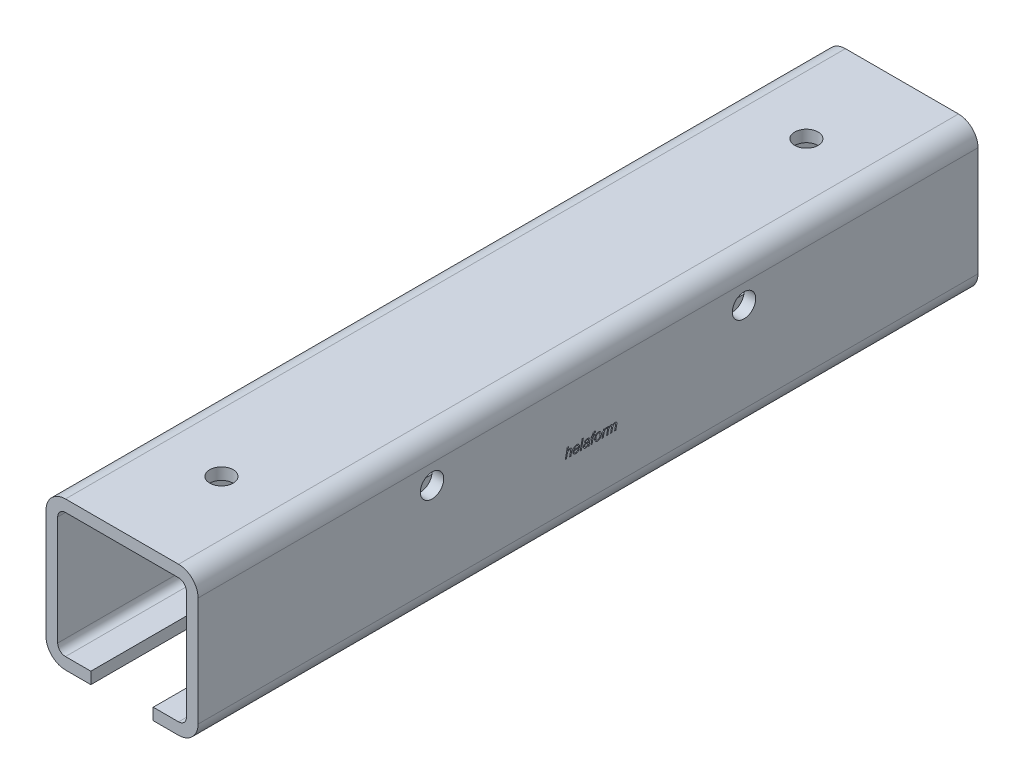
from build123d import *

# Parameters (mm, degrees)
EXTRUDE1_DEPTH     = 100
EXTRUDE2_REACH     = 110.739
SKETCH2_R          = 3
EXTRUDE3_REACH     = 115.864
SKETCH3_R          = 3
CUT_EXTRUDE1_DEPTH = 1


with BuildPart() as part:
    # Sketch1 → Extrude1 (new, symmetric)
    with BuildSketch(Plane.XY):
        with BuildLine():
            Line((0, 0), (14.5, 0))
            ThreePointArc((14.5, 0), (18.035533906, -1.464466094), (19.5, -5))
            Line((19.5, -5), (19.5, -33))
            ThreePointArc((19.5, -33), (18.035533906, -36.535533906), (14.5, -38))
            Line((14.5, -38), (8, -38))
            Line((8, -38), (8, -35))
            Line((8, -35), (14.5, -35))
            ThreePointArc((14.5, -35), (15.914213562, -34.414213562), (16.5, -33))
            Line((16.5, -33), (16.5, -5))
            ThreePointArc((16.5, -5), (15.914213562, -3.585786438), (14.5, -3))
            Line((14.5, -3), (0, -3))
            Line((0, -3), (-14.5, -3))
            ThreePointArc((-14.5, -3), (-15.914213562, -3.585786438), (-16.5, -5))
            Line((-16.5, -5), (-16.5, -33))
            ThreePointArc((-16.5, -33), (-15.914213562, -34.414213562), (-14.5, -35))
            Line((-14.5, -35), (-8, -35))
            Line((-8, -35), (-8, -38))
            Line((-8, -38), (-14.5, -38))
            ThreePointArc((-14.5, -38), (-18.035533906, -36.535533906), (-19.5, -33))
            Line((-19.5, -33), (-19.5, -5))
            ThreePointArc((-19.5, -5), (-18.035533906, -1.464466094), (-14.5, 0))
            Line((-14.5, 0), (0, 0))
        make_face()
    extrude(amount=EXTRUDE1_DEPTH, both=True)

    # Sketch2 → Extrude2 (cut, up to next)
    with BuildSketch(Plane(origin=(0, 0, 0), x_dir=(1, 0, 0), z_dir=(0, 1, 0)), mode=Mode.PRIVATE) as extrude2_sk1:
        with Locations(Location((0.5, -75, 0), (0, 0, 180))):
            Circle(SKETCH2_R)
    extrude2_tool1 = extrude(extrude2_sk1.sketch, amount=-EXTRUDE2_REACH, mode=Mode.PRIVATE) & part.part
    # Sketch2 → Extrude2 (cut, up to next)
    with BuildSketch(Plane(origin=(0, 0, 0), x_dir=(1, 0, 0), z_dir=(0, 1, 0)), mode=Mode.PRIVATE) as extrude2_sk2:
        with Locations(Location((0.5, 75, 0), (0, 0, 270))):
            Circle(SKETCH2_R)
    extrude2_tool2 = extrude(extrude2_sk2.sketch, amount=-EXTRUDE2_REACH, mode=Mode.PRIVATE) & part.part
    add(extrude2_tool1.solids().sort_by_distance((0.5, 0, 75))[0], mode=Mode.SUBTRACT)
    add(extrude2_tool2.solids().sort_by_distance((0.5, 0, -75))[0], mode=Mode.SUBTRACT)

    # Sketch3 → Extrude3 (cut, up to next)
    with BuildSketch(Plane(origin=(19.5, 0, 0), x_dir=(0, 0, -1), z_dir=(1, 0, 0)), mode=Mode.PRIVATE) as extrude3_sk1:
        with Locations(Location((-40, -10, 0), (0, 0, 90))):
            Circle(SKETCH3_R)
    extrude3_tool1 = extrude(extrude3_sk1.sketch, amount=-EXTRUDE3_REACH, mode=Mode.PRIVATE) & part.part
    # Sketch3 → Extrude3 (cut, up to next)
    with BuildSketch(Plane(origin=(19.5, 0, 0), x_dir=(0, 0, -1), z_dir=(1, 0, 0)), mode=Mode.PRIVATE) as extrude3_sk2:
        with Locations(Location((40, -10, 0), (0, 0, 90))):
            Circle(SKETCH3_R)
    extrude3_tool2 = extrude(extrude3_sk2.sketch, amount=-EXTRUDE3_REACH, mode=Mode.PRIVATE) & part.part
    add(extrude3_tool1.solids().sort_by_distance((19.5, -10, 40))[0], mode=Mode.SUBTRACT)
    add(extrude3_tool2.solids().sort_by_distance((19.5, -10, -40))[0], mode=Mode.SUBTRACT)

    # Sketch4 → Cut-Extrude1 (cut)
    # profile 1 of 8: a face of its own
    with BuildSketch(Plane(origin=(19.5, 0, 0), x_dir=(0, 0, -1), z_dir=(1, 0, 0))):
        with BuildLine():
            Line((-5.824893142, -21.343314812), (-5.312072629, -18.843314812))
            Line((-5.312072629, -18.843314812), (-5.018603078, -18.843314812))
            Line((-5.018603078, -18.843314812), (-5.21842279, -19.815870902))
            add(Edge.make_bspline(
                [(-5.21842279, -19.815870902), (-5.191202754, -19.787998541), (-5.139357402, -19.73491072), (-5.060214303, -19.664139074), (-4.98344993, -19.606682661), (-4.908891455, -19.560800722), (-4.834657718, -19.527092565), (-4.760579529, -19.501649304), (-4.68493426, -19.487584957), (-4.634206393, -19.485418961), (-4.608947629, -19.484340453)],
                knots=[0, 0, 0, 0, 1.308535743, 2.49233682, 3.562295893, 4.525943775, 5.426764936, 6.295690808, 7.151378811, 8, 8, 8, 8], degree=3))
            add(Edge.make_bspline(
                [(-4.608947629, -19.484340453), (-4.591240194, -19.484759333), (-4.55657288, -19.48557941), (-4.506105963, -19.490961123), (-4.458650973, -19.500472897), (-4.414292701, -19.513926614), (-4.37314081, -19.531653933), (-4.334693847, -19.552455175), (-4.300014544, -19.57807862), (-4.267742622, -19.606376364), (-4.239578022, -19.638453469), (-4.214393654, -19.672722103), (-4.194382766, -19.710164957), (-4.176081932, -19.749249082), (-4.163659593, -19.791560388), (-4.153838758, -19.835855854), (-4.148447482, -19.882679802), (-4.147628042, -19.914683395), (-4.147208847, -19.931055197)],
                knots=[0, 0, 0, 0, 1.169014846, 2.288677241, 3.345563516, 4.35999745, 5.342562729, 6.299516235, 7.238597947, 8.183095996, 9.127594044, 10.051288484, 10.983620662, 11.925801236, 12.894862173, 13.887022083, 14.91908212, 16, 16, 16, 16], degree=3))
            add(Edge.make_bspline(
                [(-4.147208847, -19.931055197), (-4.147476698, -19.939738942), (-4.148069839, -19.958968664), (-4.150619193, -19.990230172), (-4.155242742, -20.0264686), (-4.161975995, -20.067482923), (-4.169817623, -20.113624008), (-4.180105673, -20.164627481), (-4.191424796, -20.220796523), (-4.200212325, -20.259765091), (-4.204800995, -20.28011369)],
                knots=[0, 0, 0, 0, 0.588475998, 1.303150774, 2.123698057, 3.062574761, 4.118571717, 5.294001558, 6.586982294, 8, 8, 8, 8], degree=3))
            Line((-4.204800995, -20.28011369), (-4.441680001, -21.343314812))
            Line((-4.441680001, -21.343314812), (-4.735149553, -21.343314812))
            Line((-4.735149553, -21.343314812), (-4.497769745, -20.22151994))
            add(Edge.make_bspline(
                [(-4.497769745, -20.22151994), (-4.493759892, -20.202156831), (-4.486125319, -20.165290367), (-4.475310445, -20.112790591), (-4.467256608, -20.065734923), (-4.4592417, -20.02464505), (-4.453956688, -19.989018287), (-4.449625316, -19.959182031), (-4.447703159, -19.934914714), (-4.446995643, -19.920706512), (-4.446688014, -19.914528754)],
                knots=[0, 0, 0, 0, 1.523510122, 2.900692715, 4.129268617, 5.201396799, 6.125444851, 6.903953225, 7.523436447, 8, 8, 8, 8], degree=3))
            add(Edge.make_bspline(
                [(-4.446688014, -19.914528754), (-4.447242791, -19.900089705), (-4.448326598, -19.871881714), (-4.460205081, -19.831959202), (-4.479358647, -19.796237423), (-4.505413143, -19.764935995), (-4.539104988, -19.73949987), (-4.579826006, -19.721394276), (-4.627059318, -19.710285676), (-4.660798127, -19.709246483), (-4.678559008, -19.708699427)],
                knots=[0, 0, 0, 0, 0.987245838, 1.928674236, 2.824499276, 3.750363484, 4.697752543, 5.691079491, 6.784531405, 8, 8, 8, 8], degree=3))
            add(Edge.make_bspline(
                [(-4.678559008, -19.708699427), (-4.705524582, -19.709913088), (-4.759157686, -19.712326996), (-4.838674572, -19.730150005), (-4.916010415, -19.759363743), (-4.990344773, -19.80001549), (-5.059606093, -19.850253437), (-5.122062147, -19.909580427), (-5.176409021, -19.977572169), (-5.214572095, -20.041648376), (-5.241618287, -20.098973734), (-5.262185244, -20.148324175), (-5.281320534, -20.204230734), (-5.300984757, -20.265760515), (-5.319955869, -20.333593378), (-5.338333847, -20.407607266), (-5.356391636, -20.487751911), (-5.36745232, -20.543342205), (-5.373170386, -20.572080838)],
                knots=[0, 0, 0, 0, 1.06375668, 2.115755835, 3.200026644, 4.317463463, 5.44956746, 6.568091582, 7.707210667, 8.87448921, 9.502236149, 10.208264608, 10.983462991, 11.833661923, 12.757731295, 13.762901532, 14.843482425, 16, 16, 16, 16], degree=3))
            Line((-5.373170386, -20.572080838), (-5.531423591, -21.343314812))
            Line((-5.531423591, -21.343314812), (-5.824893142, -21.343314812))
        make_face()
    # profile 2 of 8: a face of its own
    with BuildSketch(Plane(origin=(19.5, 0, 0), x_dir=(0, 0, -1), z_dir=(1, 0, 0))):
        with BuildLine():
            Line((-2.610750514, -20.734340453), (-2.313274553, -20.766391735))
            add(Edge.make_bspline(
                [(-2.313274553, -20.766391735), (-2.319091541, -20.784554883), (-2.330837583, -20.821231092), (-2.355416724, -20.874568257), (-2.385196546, -20.927007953), (-2.41929597, -20.979465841), (-2.458935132, -21.031069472), (-2.504349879, -21.081553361), (-2.554387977, -21.131669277), (-2.609083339, -21.180331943), (-2.667224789, -21.226437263), (-2.729788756, -21.266089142), (-2.79490805, -21.299553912), (-2.862649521, -21.327572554), (-2.93331492, -21.348887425), (-3.006809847, -21.364603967), (-3.083111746, -21.373651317), (-3.134899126, -21.374789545), (-3.161131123, -21.375366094)],
                knots=[0, 0, 0, 0, 0.821440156, 1.658705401, 2.525323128, 3.419405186, 4.353419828, 5.32681938, 6.344399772, 7.404443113, 8.481060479, 9.538977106, 10.591299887, 11.633537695, 12.694215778, 13.768160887, 14.869500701, 16, 16, 16, 16], degree=3))
            add(Edge.make_bspline(
                [(-3.161131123, -21.375366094), (-3.193751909, -21.374142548), (-3.258272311, -21.371722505), (-3.353011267, -21.354518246), (-3.443491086, -21.32508148), (-3.528978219, -21.28465117), (-3.608159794, -21.233643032), (-3.676703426, -21.169657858), (-3.736723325, -21.096697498), (-3.784956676, -21.012812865), (-3.823024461, -20.921015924), (-3.849702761, -20.82217418), (-3.866835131, -20.717406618), (-3.868773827, -20.645433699), (-3.869764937, -20.608639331)],
                knots=[0, 0, 0, 0, 0.998551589, 1.975027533, 2.936744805, 3.903838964, 4.863557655, 5.807675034, 6.763178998, 7.745855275, 8.758641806, 9.797744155, 10.874151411, 12, 12, 12, 12], degree=3))
            add(Edge.make_bspline(
                [(-3.869764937, -20.608639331), (-3.869423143, -20.584084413), (-3.868738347, -20.534887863), (-3.861836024, -20.461509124), (-3.851548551, -20.388547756), (-3.836253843, -20.316392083), (-3.817375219, -20.244571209), (-3.793705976, -20.173588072), (-3.766020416, -20.103013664), (-3.734240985, -20.033644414), (-3.69925618, -19.966588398), (-3.660778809, -19.903869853), (-3.620974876, -19.844873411), (-3.577930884, -19.790801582), (-3.53200439, -19.741476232), (-3.484005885, -19.696443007), (-3.433733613, -19.655369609), (-3.380469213, -19.619541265), (-3.325710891, -19.58769044), (-3.269795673, -19.559758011), (-3.212435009, -19.536752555), (-3.153995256, -19.51787396), (-3.094690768, -19.502525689), (-3.034206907, -19.492232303), (-2.972656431, -19.485337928), (-2.931115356, -19.484674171), (-2.910229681, -19.484340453)],
                knots=[0, 0, 0, 0, 1.075906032, 2.155611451, 3.227554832, 4.30373447, 5.38628686, 6.480642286, 7.581143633, 8.707391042, 9.82337293, 10.893692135, 11.930684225, 12.940768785, 13.919223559, 14.881988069, 15.823529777, 16.761054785, 17.692163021, 18.598508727, 19.497917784, 20.397951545, 21.288749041, 22.180057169, 23.084984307, 24, 24, 24, 24], degree=3))
            add(Edge.make_bspline(
                [(-2.910229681, -19.484340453), (-2.883989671, -19.48484334), (-2.832829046, -19.485823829), (-2.758048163, -19.495638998), (-2.68741827, -19.511465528), (-2.620740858, -19.533819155), (-2.557675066, -19.56148276), (-2.49941259, -19.597107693), (-2.444994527, -19.638334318), (-2.394921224, -19.685454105), (-2.349640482, -19.737987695), (-2.310837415, -19.795984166), (-2.276624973, -19.857820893), (-2.249859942, -19.924903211), (-2.22875449, -19.996328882), (-2.213862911, -20.072443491), (-2.204738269, -20.153020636), (-2.2036527, -20.208307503), (-2.20309827, -20.236543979)],
                knots=[0, 0, 0, 0, 1.079196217, 2.10412856, 3.097265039, 4.052997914, 4.993829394, 5.924450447, 6.855882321, 7.798592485, 8.748507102, 9.702980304, 10.665060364, 11.651045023, 12.668191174, 13.725659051, 14.838433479, 16, 16, 16, 16], degree=3))
            add(Edge.make_bspline(
                [(-2.20309827, -20.236543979), (-2.204210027, -20.281525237), (-2.20647456, -20.373147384), (-2.219834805, -20.463822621), (-2.226635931, -20.509981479)],
                knots=[0, 0, 0, 0, 0.981886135, 2, 2, 2, 2], degree=3))
            Line((-2.226635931, -20.509981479), (-3.549252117, -20.509981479))
            add(Edge.make_bspline(
                [(-3.549252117, -20.509981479), (-3.554107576, -20.518907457), (-3.56326165, -20.535735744), (-3.573658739, -20.561324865), (-3.579939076, -20.585631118), (-3.580865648, -20.601597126), (-3.581303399, -20.609140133)],
                knots=[0, 0, 0, 0, 1.156942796, 2.181202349, 3.140724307, 4, 4, 4, 4], degree=3))
            add(Edge.make_bspline(
                [(-3.581303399, -20.609140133), (-3.580907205, -20.630520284), (-3.580138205, -20.672018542), (-3.57454868, -20.732247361), (-3.565693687, -20.788703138), (-3.552974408, -20.841279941), (-3.535526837, -20.889645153), (-3.51567857, -20.934659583), (-3.491835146, -20.97592498), (-3.463409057, -21.012335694), (-3.433072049, -21.045084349), (-3.400269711, -21.07293253), (-3.366642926, -21.09753248), (-3.330794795, -21.117222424), (-3.293147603, -21.13201875), (-3.254158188, -21.14337228), (-3.213441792, -21.149980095), (-3.185693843, -21.150661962), (-3.17164795, -21.15100712)],
                knots=[0, 0, 0, 0, 1.346284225, 2.613098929, 3.805631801, 4.942804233, 6.013450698, 7.039235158, 8.038108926, 9.00533571, 9.942442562, 10.84439418, 11.710848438, 12.56244313, 13.41163356, 14.253504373, 15.115931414, 16, 16, 16, 16], degree=3))
            add(Edge.make_bspline(
                [(-3.17164795, -21.15100712), (-3.144628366, -21.149846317), (-3.090141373, -21.147505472), (-3.009677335, -21.125147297), (-2.92945274, -21.092150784), (-2.865409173, -21.05282089), (-2.814961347, -21.016420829), (-2.779681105, -20.984460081), (-2.745626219, -20.950392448), (-2.714445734, -20.912684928), (-2.684563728, -20.872678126), (-2.657684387, -20.829257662), (-2.63235179, -20.78329449), (-2.618021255, -20.750817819), (-2.610750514, -20.734340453)],
                knots=[0, 0, 0, 0, 1.313044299, 2.647851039, 4.03980324, 5.527339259, 6.29475363, 7.066375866, 7.842396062, 8.63863277, 9.446691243, 10.272184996, 11.123375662, 12, 12, 12, 12], degree=3))
        make_face()
        with BuildLine():
            Line((-3.500173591, -20.285622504), (-2.493062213, -20.285622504))
            add(Edge.make_bspline(
                [(-2.493062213, -20.285622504), (-2.492702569, -20.271266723), (-2.492100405, -20.247230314), (-2.491715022, -20.223189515), (-2.491559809, -20.21350712)],
                knots=[0, 0, 0, 0, 1.194503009, 2, 2, 2, 2], degree=3))
            add(Edge.make_bspline(
                [(-2.491559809, -20.21350712), (-2.492028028, -20.193802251), (-2.492942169, -20.155330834), (-2.497601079, -20.099355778), (-2.506807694, -20.046999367), (-2.518999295, -19.998067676), (-2.535870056, -19.953031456), (-2.554978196, -19.910993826), (-2.579047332, -19.873172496), (-2.605866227, -19.838760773), (-2.635544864, -19.807991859), (-2.667488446, -19.781476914), (-2.701674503, -19.759154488), (-2.73758817, -19.740387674), (-2.776131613, -19.726625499), (-2.816243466, -19.715788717), (-2.858636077, -19.709840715), (-2.887509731, -19.709084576), (-2.90221686, -19.708699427)],
                knots=[0, 0, 0, 0, 1.288915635, 2.516454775, 3.668675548, 4.762204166, 5.808675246, 6.809806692, 7.776046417, 8.732555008, 9.659000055, 10.566141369, 11.441184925, 12.324901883, 13.209090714, 14.112018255, 15.038334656, 16, 16, 16, 16], degree=3))
            add(Edge.make_bspline(
                [(-2.90221686, -19.708699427), (-2.918442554, -19.708971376), (-2.950552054, -19.709509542), (-2.998051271, -19.717278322), (-3.044725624, -19.727721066), (-3.08992625, -19.744296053), (-3.134253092, -19.764299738), (-3.17758822, -19.788776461), (-3.219019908, -19.818958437), (-3.260211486, -19.852125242), (-3.299495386, -19.890330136), (-3.335720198, -19.933599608), (-3.370315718, -19.980764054), (-3.400779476, -20.033260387), (-3.430440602, -20.089354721), (-3.455881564, -20.150839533), (-3.4804052, -20.216263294), (-3.493482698, -20.262146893), (-3.500173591, -20.285622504)],
                knots=[0, 0, 0, 0, 0.867869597, 1.717452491, 2.571772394, 3.425671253, 4.289803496, 5.174634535, 6.084973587, 7.031591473, 8.005136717, 9.013559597, 10.050697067, 11.133079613, 12.260592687, 13.446148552, 14.693362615, 16, 16, 16, 16], degree=3))
        make_face(mode=Mode.SUBTRACT)
    # profile 3 of 8: a face of its own
    with BuildSketch(Plane(origin=(19.5, 0, 0), x_dir=(0, 0, -1), z_dir=(1, 0, 0))):
        Polygon((-2.008787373, -21.343314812), (-1.497970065, -18.843314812), (-1.204500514, -18.843314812), (-1.715317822, -21.343314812), align=None)
    # profile 4 of 8: a face of its own
    with BuildSketch(Plane(origin=(19.5, 0, 0), x_dir=(0, 0, -1), z_dir=(1, 0, 0))):
        with BuildLine():
            add(Edge.make_bspline(
                [(0.008440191, -21.11995744), (-0.017810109, -21.141534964), (-0.068535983, -21.183231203), (-0.146772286, -21.237524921), (-0.223643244, -21.281996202), (-0.299705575, -21.317173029), (-0.376182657, -21.343745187), (-0.454850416, -21.361408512), (-0.535711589, -21.373688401), (-0.590805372, -21.374804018), (-0.618563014, -21.375366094)],
                knots=[0, 0, 0, 0, 1.176742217, 2.273927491, 3.294581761, 4.249353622, 5.172863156, 6.093035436, 7.039223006, 8, 8, 8, 8], degree=3))
            add(Edge.make_bspline(
                [(-0.618563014, -21.375366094), (-0.638942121, -21.374803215), (-0.678968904, -21.37369766), (-0.737527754, -21.367454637), (-0.79296922, -21.355773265), (-0.845326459, -21.33980227), (-0.894638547, -21.319159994), (-0.941164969, -21.294127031), (-0.984116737, -21.263753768), (-1.024356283, -21.229900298), (-1.060174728, -21.191994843), (-1.091390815, -21.151107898), (-1.118214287, -21.107969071), (-1.139709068, -21.061981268), (-1.156938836, -21.013746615), (-1.16894879, -20.962694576), (-1.175924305, -20.909147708), (-1.176941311, -20.872581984), (-1.177457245, -20.85403196)],
                knots=[0, 0, 0, 0, 1.139245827, 2.237602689, 3.286124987, 4.301365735, 5.2925262, 6.269488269, 7.247875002, 8.227506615, 9.204290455, 10.15602149, 11.098561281, 12.037631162, 12.987851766, 13.95644656, 14.963292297, 16, 16, 16, 16], degree=3))
            add(Edge.make_bspline(
                [(-1.177457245, -20.85403196), (-1.176827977, -20.829589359), (-1.175594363, -20.781672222), (-1.161822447, -20.712477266), (-1.14165235, -20.647139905), (-1.111674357, -20.587136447), (-1.07500159, -20.532076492), (-1.032868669, -20.482072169), (-0.984728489, -20.438218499), (-0.931183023, -20.399774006), (-0.871509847, -20.367187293), (-0.805924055, -20.339887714), (-0.734572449, -20.316294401), (-0.684134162, -20.305970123), (-0.658126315, -20.300646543)],
                knots=[0, 0, 0, 0, 1.057058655, 2.072251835, 3.043911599, 4.010610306, 4.965012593, 5.903623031, 6.834882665, 7.777798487, 8.75171468, 9.772170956, 10.851248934, 12, 12, 12, 12], degree=3))
            add(Edge.make_bspline(
                [(-0.658126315, -20.300646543), (-0.648289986, -20.298893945), (-0.627015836, -20.295103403), (-0.592053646, -20.290830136), (-0.551652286, -20.286350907), (-0.505593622, -20.28177382), (-0.453997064, -20.27781833), (-0.396880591, -20.274513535), (-0.334298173, -20.270791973), (-0.267825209, -20.268164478), (-0.200999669, -20.265067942), (-0.137394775, -20.259946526), (-0.078784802, -20.253967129), (-0.025262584, -20.247274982), (0.023138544, -20.238582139), (0.066446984, -20.229255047), (0.105073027, -20.219003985), (0.128524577, -20.210180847), (0.139650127, -20.205995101)],
                knots=[0, 0, 0, 0, 0.595113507, 1.287119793, 2.097608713, 3.016901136, 4.044304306, 5.180150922, 6.425203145, 7.779016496, 9.143236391, 10.410139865, 11.579789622, 12.652956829, 13.622514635, 14.508107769, 15.292237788, 16, 16, 16, 16], degree=3))
            add(Edge.make_bspline(
                [(0.139650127, -20.205995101), (0.143925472, -20.184481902), (0.152089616, -20.143400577), (0.162156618, -20.084392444), (0.167059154, -20.0307975), (0.168173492, -19.997000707), (0.168696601, -19.981135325)],
                knots=[0, 0, 0, 0, 1.159062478, 2.213330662, 3.161275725, 4, 4, 4, 4], degree=3))
            add(Edge.make_bspline(
                [(0.168696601, -19.981135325), (0.168038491, -19.962808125), (0.166776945, -19.927676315), (0.151355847, -19.878529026), (0.127923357, -19.834549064), (0.10444198, -19.811828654), (0.092574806, -19.800346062)],
                knots=[0, 0, 0, 0, 1.082179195, 2.074452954, 3.026854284, 4, 4, 4, 4], degree=3))
            add(Edge.make_bspline(
                [(0.092574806, -19.800346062), (0.083568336, -19.792924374), (0.065357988, -19.777918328), (0.034165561, -19.759500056), (0.000413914, -19.743401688), (-0.03669588, -19.731049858), (-0.076376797, -19.721095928), (-0.119001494, -19.713371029), (-0.164771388, -19.709683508), (-0.196215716, -19.709033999), (-0.212413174, -19.708699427)],
                knots=[0, 0, 0, 0, 0.859677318, 1.738197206, 2.663619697, 3.613780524, 4.617262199, 5.680109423, 6.804988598, 8, 8, 8, 8], degree=3))
            add(Edge.make_bspline(
                [(-0.212413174, -19.708699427), (-0.242565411, -19.709556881), (-0.300592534, -19.711207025), (-0.383145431, -19.729389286), (-0.457822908, -19.757560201), (-0.523003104, -19.799025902), (-0.579863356, -19.850202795), (-0.62792771, -19.911487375), (-0.667970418, -19.982271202), (-0.686919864, -20.034394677), (-0.696688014, -20.06126353)],
                knots=[0, 0, 0, 0, 1.116846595, 2.149339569, 3.120005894, 4.063359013, 4.997375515, 5.94525119, 6.940808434, 8, 8, 8, 8], degree=3))
            Line((-0.696688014, -20.06126353), (-0.985149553, -20.029212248))
            add(Edge.make_bspline(
                [(-0.985149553, -20.029212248), (-0.977244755, -20.007735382), (-0.961726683, -19.965573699), (-0.934039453, -19.905011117), (-0.902623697, -19.848638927), (-0.867758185, -19.796216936), (-0.830110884, -19.747365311), (-0.789226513, -19.702130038), (-0.744147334, -19.661429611), (-0.696122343, -19.624379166), (-0.64488764, -19.591031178), (-0.59014956, -19.562530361), (-0.532104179, -19.53849541), (-0.471112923, -19.518253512), (-0.406640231, -19.503541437), (-0.339239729, -19.492573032), (-0.268500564, -19.485153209), (-0.220111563, -19.484615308), (-0.195385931, -19.484340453)],
                knots=[0, 0, 0, 0, 1.062635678, 2.086082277, 3.089150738, 4.056806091, 5.007446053, 5.951423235, 6.884447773, 7.824212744, 8.766149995, 9.719820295, 10.6859836, 11.681412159, 12.700709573, 13.753541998, 14.852113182, 16, 16, 16, 16], degree=3))
            add(Edge.make_bspline(
                [(-0.195385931, -19.484340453), (-0.169324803, -19.484795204), (-0.118425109, -19.485683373), (-0.044106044, -19.493361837), (0.026111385, -19.505636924), (0.092103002, -19.523290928), (0.154075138, -19.545504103), (0.211253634, -19.574056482), (0.265033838, -19.606304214), (0.297337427, -19.63219914), (0.313428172, -19.645097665)],
                knots=[0, 0, 0, 0, 1.147245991, 2.240673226, 3.286002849, 4.282675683, 5.245377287, 6.178960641, 7.092921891, 8, 8, 8, 8], degree=3))
            add(Edge.make_bspline(
                [(0.313428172, -19.645097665), (0.324833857, -19.655219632), (0.347394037, -19.675240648), (0.376897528, -19.708780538), (0.401683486, -19.744643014), (0.42181525, -19.782686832), (0.438239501, -19.822816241), (0.448740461, -19.865713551), (0.456355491, -19.910418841), (0.456887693, -19.941036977), (0.45715814, -19.956596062)],
                knots=[0, 0, 0, 0, 1.030059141, 2.037432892, 3.010866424, 3.970002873, 4.942258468, 5.933000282, 6.949621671, 8, 8, 8, 8], degree=3))
            add(Edge.make_bspline(
                [(0.45715814, -19.956596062), (0.456822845, -19.981819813), (0.456124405, -20.034362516), (0.448296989, -20.115852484), (0.43758851, -20.203279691), (0.427057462, -20.263128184), (0.421601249, -20.294136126)],
                knots=[0, 0, 0, 0, 0.890374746, 1.854708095, 2.888508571, 4, 4, 4, 4], degree=3))
            Line((0.421601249, -20.294136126), (0.336965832, -20.745858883))
            add(Edge.make_bspline(
                [(0.336965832, -20.745858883), (0.330856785, -20.78003868), (0.319234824, -20.845062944), (0.306849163, -20.937958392), (0.29862056, -21.020818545), (0.297448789, -21.072699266), (0.29690173, -21.096920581)],
                knots=[0, 0, 0, 0, 1.17760315, 2.240293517, 3.178453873, 4, 4, 4, 4], degree=3))
            add(Edge.make_bspline(
                [(0.29690173, -21.096920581), (0.297348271, -21.112794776), (0.298328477, -21.147640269), (0.305195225, -21.2045474), (0.314265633, -21.270971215), (0.323517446, -21.318150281), (0.32845221, -21.343314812)],
                knots=[0, 0, 0, 0, 0.765813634, 1.681039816, 2.763105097, 4, 4, 4, 4], degree=3))
            Line((0.32845221, -21.343314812), (0.037486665, -21.343314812))
            add(Edge.make_bspline(
                [(0.037486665, -21.343314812), (0.034148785, -21.327653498), (0.027079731, -21.29448554), (0.019444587, -21.241445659), (0.012841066, -21.18266027), (0.009952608, -21.141506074), (0.008440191, -21.11995744)],
                knots=[0, 0, 0, 0, 0.852057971, 1.804511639, 2.850426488, 4, 4, 4, 4], degree=3))
        make_face()
        with BuildLine():
            add(Edge.make_bspline(
                [(0.10158923, -20.401808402), (0.081379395, -20.409936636), (0.040191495, -20.42650208), (-0.0166043, -20.440943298), (-0.071695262, -20.450004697), (-0.128730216, -20.456526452), (-0.201147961, -20.464253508), (-0.254633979, -20.468555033), (-0.284027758, -20.470918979)],
                knots=[0, 0, 0, 0, 0.995082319, 2.02799051, 2.670388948, 3.546965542, 4.651910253, 6, 6, 6, 6], degree=3))
            add(Edge.make_bspline(
                [(-0.284027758, -20.470918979), (-0.305239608, -20.472990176), (-0.346030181, -20.476973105), (-0.404735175, -20.484307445), (-0.458787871, -20.490779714), (-0.508088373, -20.499259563), (-0.552938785, -20.506876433), (-0.59318207, -20.515461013), (-0.628667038, -20.524267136), (-0.668841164, -20.536731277), (-0.713218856, -20.554714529), (-0.759932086, -20.582624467), (-0.800364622, -20.615662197), (-0.832337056, -20.655311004), (-0.857339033, -20.69838295), (-0.875523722, -20.743920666), (-0.887210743, -20.791681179), (-0.88839526, -20.824416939), (-0.888995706, -20.841011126)],
                knots=[0, 0, 0, 0, 1.291140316, 2.482874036, 3.58428306, 4.588539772, 5.513036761, 6.340191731, 7.080974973, 7.727139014, 8.887871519, 9.971916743, 11.013029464, 12.033452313, 13.039540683, 14.019883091, 14.996252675, 16, 16, 16, 16], degree=3))
            add(Edge.make_bspline(
                [(-0.888995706, -20.841011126), (-0.888092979, -20.862678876), (-0.886332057, -20.904945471), (-0.868040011, -20.964965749), (-0.838949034, -21.018985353), (-0.798397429, -21.065875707), (-0.747202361, -21.104735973), (-0.684990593, -21.131485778), (-0.613774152, -21.148348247), (-0.563078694, -21.150091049), (-0.536431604, -21.15100712)],
                knots=[0, 0, 0, 0, 0.980060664, 1.911773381, 2.816178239, 3.744810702, 4.701647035, 5.704679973, 6.793509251, 8, 8, 8, 8], degree=3))
            add(Edge.make_bspline(
                [(-0.536431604, -21.15100712), (-0.510489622, -21.149847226), (-0.458485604, -21.147522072), (-0.381301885, -21.131722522), (-0.306204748, -21.104467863), (-0.233249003, -21.068428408), (-0.165655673, -21.022096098), (-0.105124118, -20.967341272), (-0.054769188, -20.903146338), (-0.020007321, -20.843531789), (0.003877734, -20.790961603), (0.020458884, -20.74693795), (0.037359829, -20.699391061), (0.052079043, -20.647608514), (0.066210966, -20.591849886), (0.078996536, -20.532006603), (0.091138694, -20.468238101), (0.098040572, -20.42436574), (0.10158923, -20.401808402)],
                knots=[0, 0, 0, 0, 1.142235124, 2.289756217, 3.452247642, 4.652135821, 5.863229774, 7.049462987, 8.231909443, 9.44094933, 10.079113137, 10.772583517, 11.511838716, 12.300429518, 13.141924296, 14.044484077, 14.994555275, 16, 16, 16, 16], degree=3))
        make_face(mode=Mode.SUBTRACT)
    # profile 5 of 8: a face of its own
    with BuildSketch(Plane(origin=(19.5, 0, 0), x_dir=(0, 0, -1), z_dir=(1, 0, 0))):
        with BuildLine():
            Line((0.745619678, -21.343314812), (1.068135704, -19.74075071))
            Line((1.068135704, -19.74075071), (0.809722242, -19.74075071))
            Line((0.809722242, -19.74075071), (0.873824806, -19.516391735))
            Line((0.873824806, -19.516391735), (1.124225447, -19.516391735))
            Line((1.124225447, -19.516391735), (1.173804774, -19.267994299))
            add(Edge.make_bspline(
                [(1.173804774, -19.267994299), (1.179918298, -19.239230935), (1.191310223, -19.185633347), (1.210410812, -19.112113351), (1.230489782, -19.051618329), (1.250526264, -19.001745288), (1.274917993, -18.959894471), (1.306201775, -18.924279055), (1.343209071, -18.891908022), (1.386780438, -18.862894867), (1.438552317, -18.838956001), (1.499708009, -18.823015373), (1.569778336, -18.813056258), (1.619646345, -18.811884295), (1.646060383, -18.81126353)],
                knots=[0, 0, 0, 0, 1.429250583, 2.663262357, 3.689602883, 4.525968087, 5.271832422, 6.031341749, 6.819062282, 7.656214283, 8.567470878, 9.577289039, 10.716740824, 12, 12, 12, 12], degree=3))
            add(Edge.make_bspline(
                [(1.646060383, -18.81126353), (1.656411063, -18.811557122), (1.678127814, -18.812173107), (1.712247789, -18.813977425), (1.749446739, -18.818343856), (1.790083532, -18.823628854), (1.833879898, -18.831528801), (1.881243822, -18.839744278), (1.931603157, -18.850439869), (1.966249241, -18.858296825), (1.984101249, -18.862345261)],
                knots=[0, 0, 0, 0, 0.72558998, 1.522359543, 2.392979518, 3.349131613, 4.393312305, 5.510664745, 6.717326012, 8, 8, 8, 8], degree=3))
            Line((1.984101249, -18.862345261), (1.928512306, -19.129272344))
            add(Edge.make_bspline(
                [(1.928512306, -19.129272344), (1.903675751, -19.124701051), (1.856312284, -19.115983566), (1.787935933, -19.107111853), (1.725958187, -19.101166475), (1.686636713, -19.100186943), (1.66809564, -19.099725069)],
                knots=[0, 0, 0, 0, 1.154599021, 2.201827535, 3.152116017, 4, 4, 4, 4], degree=3))
            add(Edge.make_bspline(
                [(1.66809564, -19.099725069), (1.654014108, -19.100030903), (1.627389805, -19.100609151), (1.59020243, -19.109551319), (1.557819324, -19.122744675), (1.529474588, -19.143480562), (1.506576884, -19.176349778), (1.486013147, -19.221766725), (1.467770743, -19.282411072), (1.45743889, -19.328016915), (1.451749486, -19.353130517)],
                knots=[0, 0, 0, 0, 0.903865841, 1.708961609, 2.445191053, 3.14337528, 3.933937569, 4.991014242, 6.34305285, 8, 8, 8, 8], degree=3))
            Line((1.451749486, -19.353130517), (1.4181958, -19.516391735))
            Line((1.4181958, -19.516391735), (1.771260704, -19.516391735))
            Line((1.771260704, -19.516391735), (1.70715814, -19.74075071))
            Line((1.70715814, -19.74075071), (1.362106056, -19.74075071))
            Line((1.362106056, -19.74075071), (1.03908923, -21.343314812))
            Line((1.03908923, -21.343314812), (0.745619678, -21.343314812))
        make_face()
    # profile 6 of 8: a face of its own
    with BuildSketch(Plane(origin=(19.5, 0, 0), x_dir=(0, 0, -1), z_dir=(1, 0, 0))):
        with BuildLine():
            add(Edge.make_bspline(
                [(1.70715814, -20.647701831), (1.708113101, -20.604423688), (1.709984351, -20.51962001), (1.724873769, -20.395322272), (1.748789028, -20.276683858), (1.782149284, -20.163509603), (1.82607768, -20.056278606), (1.879329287, -19.954816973), (1.941928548, -19.858596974), (1.991305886, -19.800189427), (2.016152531, -19.770798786)],
                knots=[0, 0, 0, 0, 1.091636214, 2.139065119, 3.15337043, 4.142118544, 5.111151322, 6.071929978, 7.029796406, 8, 8, 8, 8], degree=3))
            add(Edge.make_bspline(
                [(2.016152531, -19.770798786), (2.037684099, -19.747898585), (2.080204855, -19.702675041), (2.152261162, -19.644614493), (2.228412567, -19.594374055), (2.310422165, -19.554418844), (2.396856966, -19.522346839), (2.48858333, -19.500887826), (2.584954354, -19.486697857), (2.650948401, -19.485138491), (2.684722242, -19.484340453)],
                knots=[0, 0, 0, 0, 1.003816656, 1.982347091, 2.950416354, 3.914638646, 4.892193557, 5.891460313, 6.920910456, 8, 8, 8, 8], degree=3))
            add(Edge.make_bspline(
                [(2.684722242, -19.484340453), (2.711129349, -19.484846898), (2.762788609, -19.485837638), (2.838387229, -19.495675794), (2.910112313, -19.511351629), (2.977729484, -19.534326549), (3.041646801, -19.56254792), (3.101231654, -19.598187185), (3.157118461, -19.639804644), (3.208338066, -19.687952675), (3.255312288, -19.740806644), (3.295210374, -19.799336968), (3.329565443, -19.861834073), (3.357878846, -19.928879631), (3.379092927, -20.000693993), (3.3945708, -20.07675728), (3.404394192, -20.157160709), (3.405374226, -20.212309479), (3.405876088, -20.240550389)],
                knots=[0, 0, 0, 0, 1.074521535, 2.102047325, 3.097891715, 4.058516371, 5.004534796, 5.936932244, 6.87884093, 7.835708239, 8.794022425, 9.751637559, 10.712718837, 11.693422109, 12.708216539, 13.755795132, 14.850774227, 16, 16, 16, 16], degree=3))
            add(Edge.make_bspline(
                [(3.405876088, -20.240550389), (3.405505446, -20.266271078), (3.40476796, -20.317448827), (3.398411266, -20.393477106), (3.389098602, -20.46823177), (3.375638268, -20.54170358), (3.357411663, -20.613645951), (3.335853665, -20.684339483), (3.311003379, -20.753780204), (3.281371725, -20.821028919), (3.248605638, -20.885824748), (3.212621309, -20.947274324), (3.172714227, -21.004372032), (3.13047003, -21.058251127), (3.08391831, -21.10753008), (3.034230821, -21.153018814), (2.981797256, -21.195489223), (2.925568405, -21.232633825), (2.867840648, -21.266032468), (2.809027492, -21.295304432), (2.74943019, -21.31986598), (2.68896414, -21.339855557), (2.627872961, -21.356316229), (2.565631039, -21.366816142), (2.502955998, -21.374503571), (2.460887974, -21.375078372), (2.439830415, -21.375366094)],
                knots=[0, 0, 0, 0, 1.113712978, 2.216010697, 3.301923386, 4.375322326, 5.448404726, 6.514107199, 7.57523888, 8.640352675, 9.694367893, 10.718505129, 11.721213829, 12.709140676, 13.680905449, 14.653046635, 15.625160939, 16.599638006, 17.568089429, 18.512164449, 19.442549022, 20.357011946, 21.268841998, 22.179295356, 23.088628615, 24, 24, 24, 24], degree=3))
            add(Edge.make_bspline(
                [(2.439830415, -21.375366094), (2.405700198, -21.374391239), (2.338501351, -21.372471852), (2.240314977, -21.354798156), (2.146703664, -21.326787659), (2.058717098, -21.287369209), (1.978120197, -21.237450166), (1.906443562, -21.178037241), (1.845758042, -21.108239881), (1.795170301, -21.03001784), (1.755264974, -20.943704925), (1.727728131, -20.85054107), (1.709896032, -20.751212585), (1.708087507, -20.682838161), (1.70715814, -20.647701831)],
                knots=[0, 0, 0, 0, 1.056399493, 2.079940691, 3.079426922, 4.07698514, 5.057020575, 6.007752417, 6.949498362, 7.910468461, 8.884496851, 9.883983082, 10.912618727, 12, 12, 12, 12], degree=3))
        make_face()
        with BuildLine():
            add(Edge.make_bspline(
                [(1.995619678, -20.621159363), (1.995961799, -20.642211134), (1.996625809, -20.683069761), (2.002968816, -20.742435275), (2.012031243, -20.797963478), (2.025709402, -20.849580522), (2.043104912, -20.897297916), (2.064662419, -20.941202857), (2.090374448, -20.980893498), (2.119463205, -21.016830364), (2.152150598, -21.047881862), (2.186190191, -21.07605972), (2.223203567, -21.099110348), (2.262115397, -21.118151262), (2.303294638, -21.132849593), (2.346443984, -21.143194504), (2.39170234, -21.150049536), (2.422610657, -21.150684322), (2.438328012, -21.15100712)],
                knots=[0, 0, 0, 0, 1.295111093, 2.513634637, 3.670576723, 4.754563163, 5.794674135, 6.791678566, 7.757713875, 8.699574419, 9.629537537, 10.528041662, 11.414483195, 12.305852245, 13.189730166, 14.099209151, 15.033418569, 16, 16, 16, 16], degree=3))
            add(Edge.make_bspline(
                [(2.438328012, -21.15100712), (2.4550456, -21.150508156), (2.488646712, -21.149505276), (2.539055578, -21.141830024), (2.589021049, -21.128497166), (2.63887603, -21.11120388), (2.687557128, -21.088021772), (2.734577, -21.059341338), (2.780032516, -21.025677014), (2.822685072, -20.986346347), (2.86378078, -20.943573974), (2.901427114, -20.897097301), (2.936548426, -20.848115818), (2.97841665, -20.778274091), (3.024289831, -20.684891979), (3.050546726, -20.605653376), (3.063828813, -20.565570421)],
                knots=[0, 0, 0, 0, 0.76417638, 1.535937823, 2.324535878, 3.125956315, 3.945310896, 4.784335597, 5.640677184, 6.526804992, 7.433724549, 8.350386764, 9.258910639, 10.186940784, 12.071158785, 14, 14, 14, 14], degree=3))
            add(Edge.make_bspline(
                [(3.063828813, -20.565570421), (3.072143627, -20.537308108), (3.088483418, -20.481768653), (3.104558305, -20.397926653), (3.115245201, -20.315946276), (3.116697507, -20.261783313), (3.11741455, -20.235041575)],
                knots=[0, 0, 0, 0, 1.051458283, 2.066264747, 3.045261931, 4, 4, 4, 4], degree=3))
            add(Edge.make_bspline(
                [(3.11741455, -20.235041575), (3.117063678, -20.214823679), (3.116377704, -20.175296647), (3.110075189, -20.117937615), (3.101077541, -20.063819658), (3.086540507, -20.013597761), (3.069650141, -19.966210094), (3.046946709, -19.923003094), (3.021818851, -19.882588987), (2.991837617, -19.846598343), (2.959573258, -19.814138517), (2.924884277, -19.785813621), (2.888051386, -19.762395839), (2.849614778, -19.742175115), (2.808509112, -19.727627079), (2.765682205, -19.716336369), (2.72082084, -19.709704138), (2.69025265, -19.709038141), (2.674706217, -19.708699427)],
                knots=[0, 0, 0, 0, 1.253550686, 2.450756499, 3.575994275, 4.651243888, 5.689823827, 6.690069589, 7.672416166, 8.636253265, 9.588057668, 10.508190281, 11.407164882, 12.291652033, 13.195740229, 14.104854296, 15.036162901, 16, 16, 16, 16], degree=3))
            add(Edge.make_bspline(
                [(2.674706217, -19.708699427), (2.65061008, -19.709585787), (2.603061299, -19.711334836), (2.533434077, -19.724622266), (2.467036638, -19.746828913), (2.404292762, -19.7782639), (2.344543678, -19.81771179), (2.288365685, -19.865921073), (2.234698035, -19.921742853), (2.184211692, -19.985064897), (2.139146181, -20.055546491), (2.098807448, -20.131571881), (2.066903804, -20.214029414), (2.040651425, -20.299964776), (2.021559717, -20.386062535), (2.006453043, -20.468678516), (1.997701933, -20.546517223), (1.996295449, -20.596935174), (1.995619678, -20.621159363)],
                knots=[0, 0, 0, 0, 0.919050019, 1.813556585, 2.693819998, 3.582615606, 4.483630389, 5.419133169, 6.401208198, 7.434815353, 8.503776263, 9.589310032, 10.713026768, 11.871659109, 13.015133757, 14.075998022, 15.075579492, 16, 16, 16, 16], degree=3))
        make_face(mode=Mode.SUBTRACT)
    # profile 7 of 8: a face of its own
    with BuildSketch(Plane(origin=(19.5, 0, 0), x_dir=(0, 0, -1), z_dir=(1, 0, 0))):
        with BuildLine():
            Line((3.598183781, -21.343314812), (3.982799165, -19.516391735))
            Line((3.982799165, -19.516391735), (4.276268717, -19.516391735))
            Line((4.276268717, -19.516391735), (4.188628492, -19.830394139))
            add(Edge.make_bspline(
                [(4.188628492, -19.830394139), (4.213011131, -19.80255268), (4.259562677, -19.749397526), (4.331311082, -19.677916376), (4.400886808, -19.617824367), (4.468891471, -19.568966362), (4.536370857, -19.530897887), (4.604360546, -19.503993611), (4.673320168, -19.487827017), (4.719563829, -19.485496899), (4.74251471, -19.484340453)],
                knots=[0, 0, 0, 0, 1.317415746, 2.515221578, 3.602797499, 4.587383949, 5.492011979, 6.354026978, 7.183098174, 8, 8, 8, 8], degree=3))
            add(Edge.make_bspline(
                [(4.74251471, -19.484340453), (4.758723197, -19.484767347), (4.792907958, -19.485667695), (4.846574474, -19.492166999), (4.905406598, -19.502194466), (4.946049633, -19.511506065), (4.967374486, -19.516391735)],
                knots=[0, 0, 0, 0, 0.854454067, 1.802099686, 2.846791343, 4, 4, 4, 4], degree=3))
            Line((4.967374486, -19.516391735), (4.842174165, -19.804853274))
            add(Edge.make_bspline(
                [(4.842174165, -19.804853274), (4.829188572, -19.79024871), (4.80462494, -19.762622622), (4.761248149, -19.732037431), (4.715762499, -19.71212321), (4.684111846, -19.709835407), (4.668396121, -19.708699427)],
                knots=[0, 0, 0, 0, 1.139610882, 2.155695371, 3.084234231, 4, 4, 4, 4], degree=3))
            add(Edge.make_bspline(
                [(4.668396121, -19.708699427), (4.654819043, -19.709256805), (4.627171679, -19.710391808), (4.585925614, -19.720583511), (4.544213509, -19.736345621), (4.502216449, -19.758698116), (4.459567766, -19.786989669), (4.416292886, -19.821274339), (4.372830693, -19.862183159), (4.328376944, -19.909197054), (4.285007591, -19.964708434), (4.24383736, -20.029976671), (4.205204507, -20.105262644), (4.168192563, -20.190266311), (4.133136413, -20.285034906), (4.101210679, -20.389938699), (4.069593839, -20.504307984), (4.052023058, -20.584505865), (4.042895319, -20.626167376)],
                knots=[0, 0, 0, 0, 0.549463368, 1.118886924, 1.711931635, 2.353427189, 3.042026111, 3.783708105, 4.587857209, 5.458936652, 6.403515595, 7.437581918, 8.58132111, 9.829397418, 11.192852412, 12.673529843, 14.271952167, 16, 16, 16, 16], degree=3))
            Line((4.042895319, -20.626167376), (3.892154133, -21.343314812))
            Line((3.892154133, -21.343314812), (3.598183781, -21.343314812))
        make_face()
    # profile 8 of 8: a face of its own
    with BuildSketch(Plane(origin=(19.5, 0, 0), x_dir=(0, 0, -1), z_dir=(1, 0, 0))):
        with BuildLine():
            Line((4.752029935, -21.343314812), (5.120118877, -19.516391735))
            Line((5.120118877, -19.516391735), (5.413588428, -19.516391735))
            Line((5.413588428, -19.516391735), (5.347482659, -19.84241337))
            add(Edge.make_bspline(
                [(5.347482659, -19.84241337), (5.361230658, -19.825960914), (5.387789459, -19.794177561), (5.428216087, -19.749411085), (5.467078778, -19.70828271), (5.505132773, -19.671149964), (5.5421179, -19.638123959), (5.577901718, -19.608928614), (5.612122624, -19.583102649), (5.656899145, -19.555421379), (5.712970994, -19.526292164), (5.78390843, -19.50236597), (5.857493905, -19.48725158), (5.90763953, -19.485316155), (5.932919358, -19.484340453)],
                knots=[0, 0, 0, 0, 1.084132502, 2.094360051, 3.049733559, 3.945196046, 4.782250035, 5.556179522, 6.280499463, 6.948038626, 8.216550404, 9.465929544, 10.722503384, 12, 12, 12, 12], degree=3))
            add(Edge.make_bspline(
                [(5.932919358, -19.484340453), (5.959214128, -19.485338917), (6.010191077, -19.487274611), (6.083394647, -19.503937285), (6.149504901, -19.532517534), (6.20868878, -19.571278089), (6.259802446, -19.620246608), (6.301139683, -19.678848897), (6.333503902, -19.746026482), (6.346089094, -19.795051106), (6.352590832, -19.820378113)],
                knots=[0, 0, 0, 0, 1.075592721, 2.085222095, 3.052587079, 4.009808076, 4.966833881, 5.932096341, 6.931683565, 8, 8, 8, 8], degree=3))
            add(Edge.make_bspline(
                [(6.352590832, -19.820378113), (6.37486026, -19.793617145), (6.417977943, -19.74180302), (6.487790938, -19.672738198), (6.55968737, -19.614772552), (6.633199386, -19.567072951), (6.708945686, -19.529858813), (6.787004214, -19.504080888), (6.866833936, -19.48689841), (6.920912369, -19.485195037), (6.948043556, -19.484340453)],
                knots=[0, 0, 0, 0, 1.178955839, 2.282673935, 3.320441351, 4.302439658, 5.245851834, 6.17043085, 7.082103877, 8, 8, 8, 8], degree=3))
            add(Edge.make_bspline(
                [(6.948043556, -19.484340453), (6.965914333, -19.484798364), (7.000558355, -19.485686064), (7.050866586, -19.49042404), (7.097611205, -19.499495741), (7.140880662, -19.511988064), (7.180920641, -19.527816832), (7.216959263, -19.548339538), (7.25059511, -19.570956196), (7.279479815, -19.598676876), (7.305893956, -19.628458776), (7.32770696, -19.662038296), (7.347092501, -19.697704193), (7.362541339, -19.736560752), (7.374610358, -19.778329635), (7.382802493, -19.823138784), (7.38872098, -19.870635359), (7.38907069, -19.90332458), (7.389249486, -19.920037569)],
                knots=[0, 0, 0, 0, 1.211510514, 2.348616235, 3.420404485, 4.433742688, 5.398144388, 6.330073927, 7.240321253, 8.136965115, 9.035320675, 9.932820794, 10.843981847, 11.783163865, 12.760750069, 13.785957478, 14.868028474, 16, 16, 16, 16], degree=3))
            add(Edge.make_bspline(
                [(7.389249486, -19.920037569), (7.38864018, -19.936080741), (7.387251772, -19.972637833), (7.378948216, -20.034138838), (7.365714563, -20.108858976), (7.354663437, -20.163118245), (7.348684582, -20.192473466)],
                knots=[0, 0, 0, 0, 0.698199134, 1.590965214, 2.696669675, 4, 4, 4, 4], degree=3))
            Line((7.348684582, -20.192473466), (7.096781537, -21.343314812))
            Line((7.096781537, -21.343314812), (6.803311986, -21.343314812))
            Line((6.803311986, -21.343314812), (7.046701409, -20.118855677))
            add(Edge.make_bspline(
                [(7.046701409, -20.118855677), (7.051534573, -20.095681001), (7.060447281, -20.052945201), (7.070462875, -19.993826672), (7.077132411, -19.945392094), (7.078261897, -19.91654627), (7.078752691, -19.904011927)],
                knots=[0, 0, 0, 0, 1.305873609, 2.408126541, 3.308285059, 4, 4, 4, 4], degree=3))
            add(Edge.make_bspline(
                [(7.078752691, -19.904011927), (7.078088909, -19.88960277), (7.076820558, -19.862069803), (7.066943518, -19.822902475), (7.048773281, -19.789131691), (7.024497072, -19.760163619), (6.993968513, -19.736785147), (6.957588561, -19.720022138), (6.915614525, -19.71071995), (6.88599033, -19.709395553), (6.870419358, -19.708699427)],
                knots=[0, 0, 0, 0, 1.069480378, 2.043559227, 2.969528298, 3.893171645, 4.83027303, 5.800717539, 6.844020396, 8, 8, 8, 8], degree=3))
            add(Edge.make_bspline(
                [(6.870419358, -19.708699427), (6.847956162, -19.709800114), (6.802273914, -19.712038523), (6.733813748, -19.72951678), (6.665193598, -19.758232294), (6.597360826, -19.796849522), (6.532405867, -19.843762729), (6.474712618, -19.899376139), (6.423955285, -19.961304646), (6.388800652, -20.019317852), (6.363640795, -20.07018539), (6.345710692, -20.113614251), (6.328226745, -20.161751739), (6.311270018, -20.214899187), (6.294874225, -20.272889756), (6.278858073, -20.3356784), (6.263252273, -20.403091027), (6.254123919, -20.449855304), (6.249425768, -20.473923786)],
                knots=[0, 0, 0, 0, 1.002413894, 2.038557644, 3.13511723, 4.316968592, 5.517416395, 6.703891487, 7.885766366, 9.083896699, 9.724082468, 10.419176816, 11.181001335, 12.010956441, 12.910124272, 13.872130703, 14.904835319, 16, 16, 16, 16], degree=3))
            Line((6.249425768, -20.473923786), (6.071140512, -21.343314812))
            Line((6.071140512, -21.343314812), (5.77767096, -21.343314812))
            Line((5.77767096, -21.343314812), (6.026068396, -20.09231321))
            add(Edge.make_bspline(
                [(6.026068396, -20.09231321), (6.030218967, -20.072641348), (6.037865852, -20.036398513), (6.04631786, -19.986455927), (6.051996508, -19.945707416), (6.052773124, -19.921552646), (6.053111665, -19.911023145)],
                knots=[0, 0, 0, 0, 1.314093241, 2.421045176, 3.311705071, 4, 4, 4, 4], degree=3))
            add(Edge.make_bspline(
                [(6.053111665, -19.911023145), (6.052435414, -19.896610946), (6.051128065, -19.868748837), (6.04118962, -19.829100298), (6.02366138, -19.793956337), (5.999462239, -19.764095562), (5.970448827, -19.739188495), (5.936577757, -19.721378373), (5.898691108, -19.710505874), (5.872063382, -19.70931498), (5.858299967, -19.708699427)],
                knots=[0, 0, 0, 0, 1.096501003, 2.119789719, 3.085930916, 4.062380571, 5.027267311, 5.976631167, 6.954155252, 8, 8, 8, 8], degree=3))
            add(Edge.make_bspline(
                [(5.858299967, -19.708699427), (5.836501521, -19.709805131), (5.791969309, -19.712063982), (5.724748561, -19.729763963), (5.656632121, -19.758430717), (5.587623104, -19.796375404), (5.521507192, -19.844816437), (5.460238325, -19.902073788), (5.406709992, -19.96917894), (5.36691551, -20.031123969), (5.338629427, -20.086071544), (5.318016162, -20.131853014), (5.298688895, -20.181907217), (5.280042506, -20.236172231), (5.262854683, -20.294783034), (5.245562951, -20.357250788), (5.230156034, -20.424136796), (5.220991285, -20.470226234), (5.216272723, -20.493955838)],
                knots=[0, 0, 0, 0, 0.949721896, 1.940194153, 3.010855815, 4.167592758, 5.365912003, 6.576090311, 7.813033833, 9.099392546, 9.779864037, 10.506433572, 11.287789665, 12.118837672, 13.007836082, 13.950838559, 14.94496891, 16, 16, 16, 16], degree=3))
            Line((5.216272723, -20.493955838), (5.044998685, -21.343314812))
            Line((5.044998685, -21.343314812), (4.752029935, -21.343314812))
        make_face()
    extrude(amount=-CUT_EXTRUDE1_DEPTH, mode=Mode.SUBTRACT)


solid = part.part
